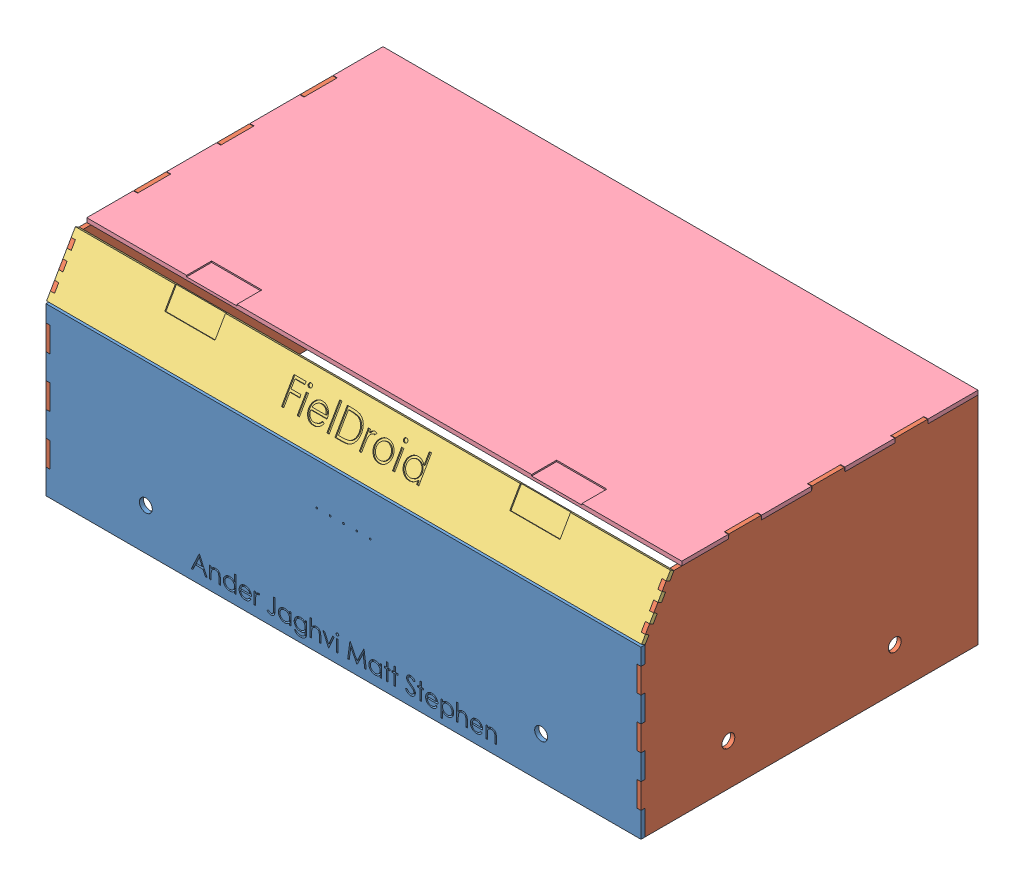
SolidWorks assembly caseStephen.SLDASM, configuration Default (file format 7000). Lengths in mm.
Overall size (454.03 168.28 257.18).
5 component instances, 4 part files, 12 mates.
Components (placement in the parent):
- frontStephen-1: frontStephen.SLDPRT [Default] at (-12.3899 221.0674 442.6868) size (454.03 127 3.17)
- sideStephen-1: sideStephen.SLDPRT [Default] at (-9.2149 221.0674 188.6868) x (0 0 1) z (-1 0 0) size (257.18 168.28 3.17)
- slantStephen-1: slantStephen.SLDPRT [Default] at (-12.3899 348.1125 442.6607) x (1 0 0) z (0 0.5 0.866025) size (454.03 43.94 3.17)
- topStephen-1: topStephen.SLDPRT [Default] at (-12.3899 386.1674 414.7468) x (1 0 0) z (0 1 0) size (454.03 226.06 3.17)
- sideStephen-2: sideStephen.SLDPRT [Default] at (441.6351 221.0674 188.6868) x (0 0 1) z (-1 0 0) size (257.18 168.28 3.17)
Mates (geometry in assembly coordinates):
- Coincident1: coincident anti-aligned: plane of frontStephen-1 through (-12.3899 221.0674 442.6868) normal (0 0 -1); plane of sideStephen-1 through (-12.3899 348.0674 442.6868) normal (0 0 1)
- Coincident2: coincident aligned: plane of frontStephen-1 through (-12.3899 297.2674 445.8618) normal (-1 0 0); plane of sideStephen-1 through (-12.3899 386.1674 239.4868) normal (-1 0 0)
- Coincident3: coincident aligned: plane of frontStephen-1 through (441.6351 221.0674 445.8618) normal (0 -1 0); plane of sideStephen-1 through (-12.3899 221.0674 442.6868) normal (0 -1 0)
- Coincident4: coincident aligned: plane of sideStephen-1 through (-12.3899 386.1674 239.4868) normal (-1 0 0); plane of slantStephen-1 through (-12.3899 382.2556 426.6143) normal (-1 0 0)
- Coincident5: coincident anti-aligned: plane of sideStephen-1 through (-12.3899 376.7563 429.7893) normal (0 -0.866025 0.5); plane of slantStephen-1 through (-9.2149 376.7563 429.7893) normal (0 0.866025 -0.5)
- Coincident6: coincident aligned: plane of sideStephen-1 through (-12.3899 371.2571 432.9643) normal (0 0.5 0.866025); plane of slantStephen-1 through (-12.3899 349.7 445.4103) normal (0 0.5 0.866025)
- Coincident7: coincident aligned: plane of sideStephen-1 through (-12.3899 389.3424 227.19) normal (0 1 0); plane of topStephen-1 through (-12.3899 389.3424 414.7468) normal (0 1 0)
- Coincident8: coincident aligned: plane of sideStephen-1 through (-12.3899 386.1674 239.4868) normal (-1 0 0); plane of topStephen-1 through (-12.3899 389.3424 414.7468) normal (-1 0 0)
- Coincident9: coincident aligned: plane of sideStephen-1 through (-12.3899 221.0674 188.6868) normal (0 0 -1); plane of topStephen-1 through (-12.3899 389.3424 188.6868) normal (0 0 -1)
- Coincident10: coincident anti-aligned: plane of topStephen-1 through (438.4601 389.3424 353.7868) normal (1 0 0); plane of sideStephen-2 through (438.4601 386.1674 239.4868) normal (-1 0 0)
- Coincident11: coincident aligned: plane of frontStephen-1 through (-12.3899 221.0674 445.8618) normal (0 0 1); plane of sideStephen-2 through (438.4601 278.2174 445.8618) normal (0 0 1)
- Coincident12: coincident aligned: plane of topStephen-1 through (-12.3899 389.3424 414.7468) normal (0 1 0); plane of sideStephen-2 through (438.4601 389.3424 290.69) normal (0 1 0)
